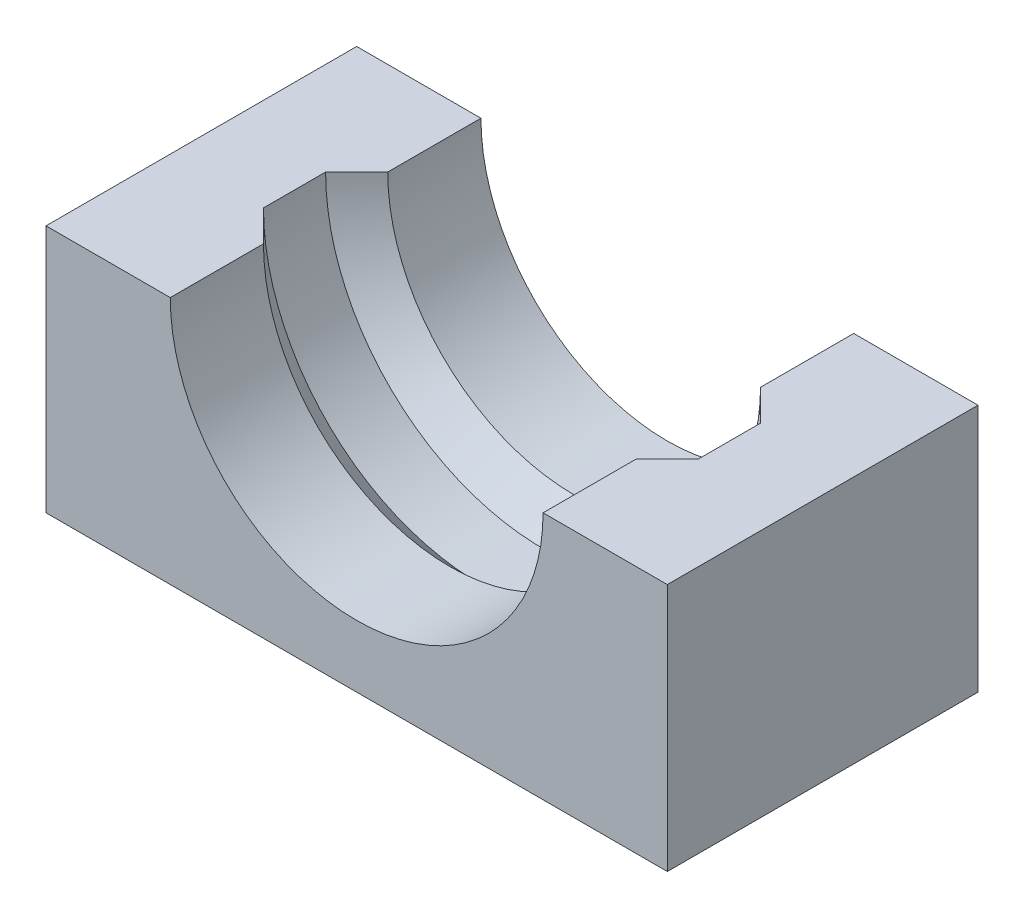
from build123d import *

# Parameters (mm, degrees)
EXTRUDE1_DEPTH     = 25
CUT_REVOLVE1_ANGLE = 180


with BuildPart() as part:
    # Sketch2 → Extrude1 (new, symmetric)
    with BuildSketch(Plane.XY):
        with BuildLine():
            Line((0, 0), (0, 40))
            Line((0, 40), (20, 40))
            ThreePointArc((20, 40), (50, 10), (80, 40))
            Line((80, 40), (100, 40))
            Line((100, 40), (100, 0))
            Line((100, 0), (0, 0))
        make_face()
    extrude(amount=EXTRUDE1_DEPTH, both=True)

    # Sketch3 → Cut-Revolve1 (revolve, cut)
    with BuildSketch(Plane(origin=(0, 40, 0), x_dir=(-1, 0, 0), z_dir=(0, 1, 0))):
        Polygon((-20, 10), (-20, -10), (-15, -5), (-15, 5), align=None)
    revolve(axis=Axis((50, 40, -25), (0, 0, 1)), revolution_arc=CUT_REVOLVE1_ANGLE, mode=Mode.SUBTRACT)


solid = part.part
